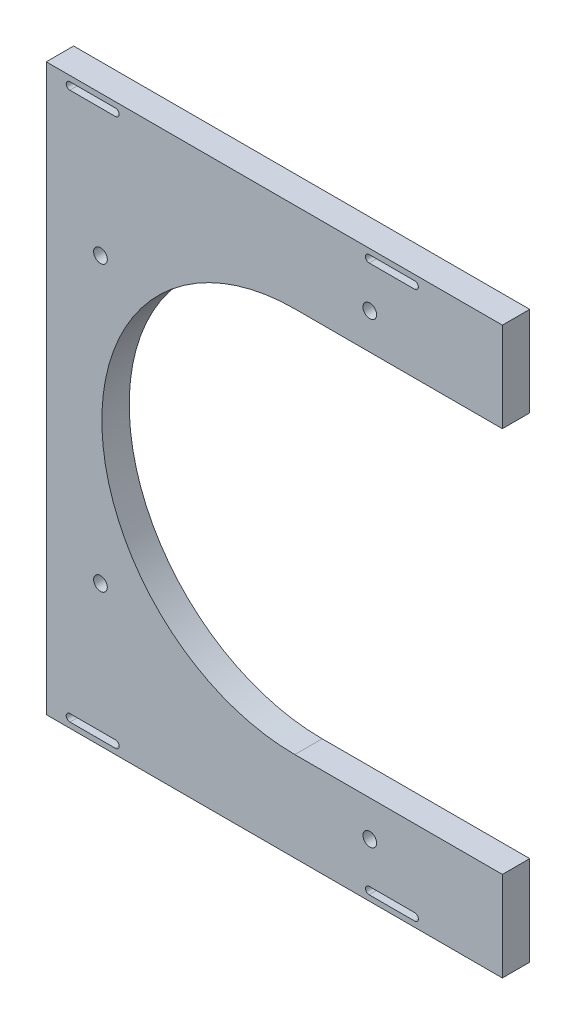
from build123d import *

# Parameters (mm, degrees)
SKETCH1_W                       = 317.599342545
SKETCH1_H                       = 393.699553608
EXTRUDE1_DEPTH                  = 19.05
CUT_EXTRUDE2_DEPTH              = 642.628007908
F_3_8_0_375000_DIAMETER_HOLE1_D = 9.525
SKETCH10_R                      = 11.1125
CUT_EXTRUDE3_DEPTH              = 9.525


with BuildPart() as part:
    # Sketch1 → Extrude1 (new body)
    with BuildSketch(Plane.XY):
        with Locations((451.588535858, 0)):
            Rectangle(SKETCH1_W, SKETCH1_H)
    extrude(amount=EXTRUDE1_DEPTH)

    # Sketch6 → Cut-Extrude2 (cut, through all)
    with BuildSketch(Plane.XY.offset(19.05)):
        with BuildLine():
            Line((610.38820713, 134.373349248), (465.86220713, 134.373349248))
            ThreePointArc((465.86220713, 134.373349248), (331.488857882, 0), (465.86220713, -134.373349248))
            Line((465.86220713, -134.373349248), (610.38820713, -134.373349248))
            Line((610.38820713, -134.373349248), (610.38820713, 134.373349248))
        make_face()
        with BuildLine():
            Line((340.979627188, 187.947076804), (309.229627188, 187.947076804))
            ThreePointArc((309.229627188, 187.947076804), (306.676927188, 190.499776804), (309.229627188, 193.052476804))
            Line((309.229627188, 193.052476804), (340.979627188, 193.052476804))
            ThreePointArc((340.979627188, 193.052476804), (343.532327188, 190.499776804), (340.979627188, 187.947076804))
        make_face()
        with BuildLine():
            Line((517.599353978, 193.052476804), (549.349353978, 193.052476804))
            ThreePointArc((549.349353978, 193.052476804), (551.902053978, 190.499776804), (549.349353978, 187.947076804))
            Line((549.349353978, 187.947076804), (517.599353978, 187.947076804))
            ThreePointArc((517.599353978, 187.947076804), (515.046653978, 190.499776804), (517.599353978, 193.052476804))
        make_face()
        with BuildLine():
            Line((517.599353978, -187.947076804), (549.349353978, -187.947076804))
            ThreePointArc((549.349353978, -187.947076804), (551.902053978, -190.499776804), (549.349353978, -193.052476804))
            Line((549.349353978, -193.052476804), (517.599353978, -193.052476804))
            ThreePointArc((517.599353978, -193.052476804), (515.046653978, -190.499776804), (517.599353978, -187.947076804))
        make_face()
        with BuildLine():
            Line((340.979627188, -193.052476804), (309.229627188, -193.052476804))
            ThreePointArc((309.229627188, -193.052476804), (306.676927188, -190.499776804), (309.229627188, -187.947076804))
            Line((309.229627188, -187.947076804), (340.979627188, -187.947076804))
            ThreePointArc((340.979627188, -187.947076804), (343.532327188, -190.499776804), (340.979627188, -193.052476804))
        make_face()
    extrude(amount=-CUT_EXTRUDE2_DEPTH, mode=Mode.SUBTRACT)

    # 3_8 _0.375000_ Diameter Hole1 (through all)
    with Locations(Plane(origin=(0, 0, 0), x_dir=(-1, 0, 0), z_dir=(0, 0, -1))):
        with Locations((-518.073121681, 159.302197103), (-330.52675791, 98.865858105), (-330.52675791, -98.865858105), (-518.073121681, -159.302197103)):
            Hole(F_3_8_0_375000_DIAMETER_HOLE1_D / 2)

    # Sketch10 → Cut-Extrude3 (cut)
    with BuildSketch(Plane(origin=(0, 0, 0), x_dir=(-1, 0, 0), z_dir=(0, 0, -1))):
        with Locations((-518.073121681, 159.302197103)):
            Circle(SKETCH10_R)
        with Locations((-330.52675791, 98.865858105)):
            Circle(SKETCH10_R)
        with Locations((-330.52675791, -98.865858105)):
            Circle(SKETCH10_R)
        with Locations((-518.073121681, -159.302197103)):
            Circle(SKETCH10_R)
    extrude(amount=-CUT_EXTRUDE3_DEPTH, mode=Mode.SUBTRACT)


solid = part.part
